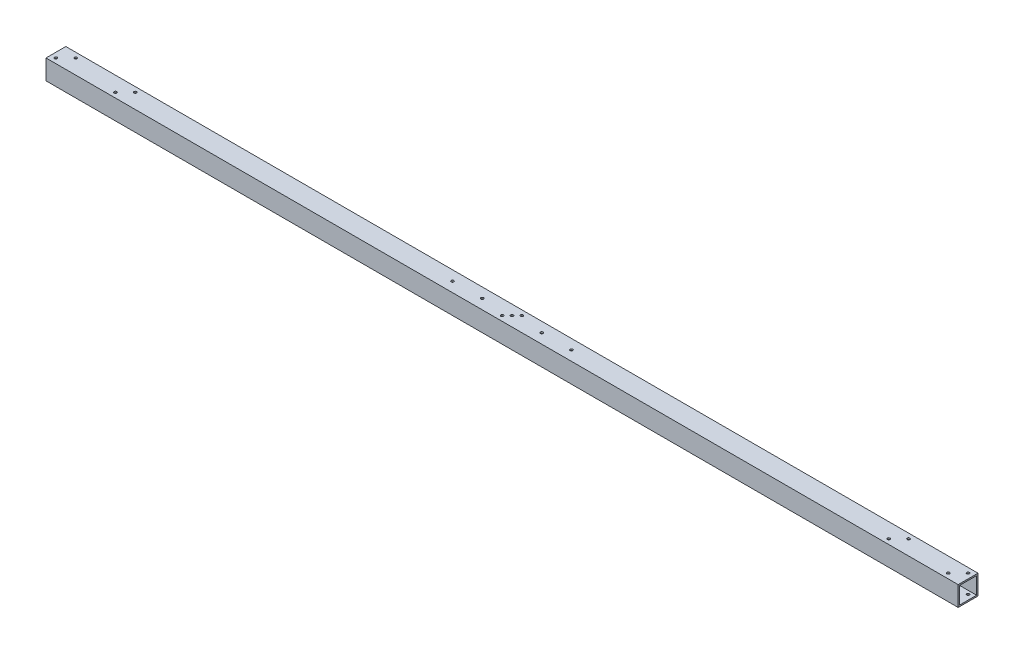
ISO-10303-21;
HEADER;
FILE_DESCRIPTION(('STEP AP214'),'2;1');
FILE_NAME('part.step','',(''),(''),'','','');
FILE_SCHEMA(('AUTOMOTIVE_DESIGN { 1 0 10303 214 1 1 1 1 }'));
ENDSEC;
DATA;
#1=APPLICATION_CONTEXT('core data for automotive mechanical design processes');
#2=APPLICATION_PROTOCOL_DEFINITION('international standard','automotive_design',2000,#1);
#3=PRODUCT_CONTEXT('',#1,'mechanical');
#4=PRODUCT('Part','Part','',(#3));
#5=PRODUCT_RELATED_PRODUCT_CATEGORY('part','',(#4));
#6=PRODUCT_DEFINITION_FORMATION('','',#4);
#7=PRODUCT_DEFINITION_CONTEXT('part definition',#1,'design');
#8=PRODUCT_DEFINITION('design','',#6,#7);
#9=PRODUCT_DEFINITION_SHAPE('','',#8);
#10=(LENGTH_UNIT() NAMED_UNIT(*) SI_UNIT(.MILLI.,.METRE.));
#11=(NAMED_UNIT(*) PLANE_ANGLE_UNIT() SI_UNIT($,.RADIAN.));
#12=(NAMED_UNIT(*) SI_UNIT($,.STERADIAN.) SOLID_ANGLE_UNIT());
#13=UNCERTAINTY_MEASURE_WITH_UNIT(LENGTH_MEASURE(1.E-05),#10,'distance_accuracy_value','');
#14=(GEOMETRIC_REPRESENTATION_CONTEXT(3) GLOBAL_UNCERTAINTY_ASSIGNED_CONTEXT((#13)) GLOBAL_UNIT_ASSIGNED_CONTEXT((#10,
#11,#12)) REPRESENTATION_CONTEXT('',''));
#15=CARTESIAN_POINT('',(0.,0.,0.));
#16=DIRECTION('',(0.,0.,1.));
#17=DIRECTION('',(1.,0.,0.));
#18=AXIS2_PLACEMENT_3D('',#15,#16,#17);
#19=CARTESIAN_POINT('',(2336.8,50.8,0.));
#20=DIRECTION('',(-1.,0.,0.));
#21=DIRECTION('',(0.,0.,1.));
#22=AXIS2_PLACEMENT_3D('',#19,#20,#21);
#23=PLANE('',#22);
#24=DIRECTION('',(0.,-1.,0.));
#25=VECTOR('',#24,1.);
#26=CARTESIAN_POINT('',(2336.8,0.,0.));
#27=LINE('',#26,#25);
#28=CARTESIAN_POINT('',(2336.8,50.8,0.));
#29=VERTEX_POINT('',#28);
#30=CARTESIAN_POINT('',(2336.8,0.,0.));
#31=VERTEX_POINT('',#30);
#32=EDGE_CURVE('E135',#29,#31,#27,.T.);
#33=ORIENTED_EDGE('',*,*,#32,.T.);
#34=DIRECTION('',(0.,0.,-1.));
#35=VECTOR('',#34,1.);
#36=CARTESIAN_POINT('',(2336.8,0.,0.));
#37=LINE('',#36,#35);
#38=CARTESIAN_POINT('',(2336.8,0.,-50.8));
#39=VERTEX_POINT('',#38);
#40=EDGE_CURVE('E138',#31,#39,#37,.T.);
#41=ORIENTED_EDGE('',*,*,#40,.T.);
#42=DIRECTION('',(0.,1.,0.));
#43=VECTOR('',#42,1.);
#44=CARTESIAN_POINT('',(2336.8,0.,-50.8));
#45=LINE('',#44,#43);
#46=CARTESIAN_POINT('',(2336.8,50.8,-50.8));
#47=VERTEX_POINT('',#46);
#48=EDGE_CURVE('E141',#39,#47,#45,.T.);
#49=ORIENTED_EDGE('',*,*,#48,.T.);
#50=DIRECTION('',(0.,0.,1.));
#51=VECTOR('',#50,1.);
#52=CARTESIAN_POINT('',(2336.8,50.8,0.));
#53=LINE('',#52,#51);
#54=EDGE_CURVE('E143',#47,#29,#53,.T.);
#55=ORIENTED_EDGE('',*,*,#54,.T.);
#56=EDGE_LOOP('',(#33,#41,#49,#55));
#57=FACE_BOUND('',#56,.T.);
#58=DIRECTION('',(0.,-1.,0.));
#59=VECTOR('',#58,1.);
#60=CARTESIAN_POINT('',(2336.8,47.1424,-3.6576));
#61=LINE('',#60,#59);
#62=CARTESIAN_POINT('',(2336.8,47.1424,-3.6576));
#63=VERTEX_POINT('',#62);
#64=CARTESIAN_POINT('',(2336.8,3.6576,-3.6576));
#65=VERTEX_POINT('',#64);
#66=EDGE_CURVE('E97',#63,#65,#61,.T.);
#67=ORIENTED_EDGE('',*,*,#66,.F.);
#68=DIRECTION('',(0.,0.,1.));
#69=VECTOR('',#68,1.);
#70=CARTESIAN_POINT('',(2336.8,47.1424,-3.6576));
#71=LINE('',#70,#69);
#72=CARTESIAN_POINT('',(2336.8,47.1424,-47.1424));
#73=VERTEX_POINT('',#72);
#74=EDGE_CURVE('E119',#73,#63,#71,.T.);
#75=ORIENTED_EDGE('',*,*,#74,.F.);
#76=DIRECTION('',(0.,1.,0.));
#77=VECTOR('',#76,1.);
#78=CARTESIAN_POINT('',(2336.8,47.1424,-47.1424));
#79=LINE('',#78,#77);
#80=CARTESIAN_POINT('',(2336.8,3.6576,-47.1424));
#81=VERTEX_POINT('',#80);
#82=EDGE_CURVE('E117',#81,#73,#79,.T.);
#83=ORIENTED_EDGE('',*,*,#82,.F.);
#84=DIRECTION('',(0.,0.,-1.));
#85=VECTOR('',#84,1.);
#86=CARTESIAN_POINT('',(2336.8,3.6576,-3.6576));
#87=LINE('',#86,#85);
#88=EDGE_CURVE('E105',#65,#81,#87,.T.);
#89=ORIENTED_EDGE('',*,*,#88,.F.);
#90=EDGE_LOOP('',(#67,#75,#83,#89));
#91=FACE_BOUND('',#90,.T.);
#92=ADVANCED_FACE('F30',(#57,#91),#23,.F.);
#93=CARTESIAN_POINT('',(0.,50.8,0.));
#94=DIRECTION('',(-1.,0.,0.));
#95=DIRECTION('',(0.,0.,1.));
#96=AXIS2_PLACEMENT_3D('',#93,#94,#95);
#97=PLANE('',#96);
#98=DIRECTION('',(0.,-1.,0.));
#99=VECTOR('',#98,1.);
#100=CARTESIAN_POINT('',(0.,0.,0.));
#101=LINE('',#100,#99);
#102=CARTESIAN_POINT('',(0.,50.8,0.));
#103=VERTEX_POINT('',#102);
#104=CARTESIAN_POINT('',(0.,0.,0.));
#105=VERTEX_POINT('',#104);
#106=EDGE_CURVE('E113',#103,#105,#101,.T.);
#107=ORIENTED_EDGE('',*,*,#106,.F.);
#108=DIRECTION('',(0.,0.,1.));
#109=VECTOR('',#108,1.);
#110=CARTESIAN_POINT('',(0.,50.8,0.));
#111=LINE('',#110,#109);
#112=CARTESIAN_POINT('',(0.,50.8,-50.8));
#113=VERTEX_POINT('',#112);
#114=EDGE_CURVE('E139',#113,#103,#111,.T.);
#115=ORIENTED_EDGE('',*,*,#114,.F.);
#116=DIRECTION('',(0.,1.,0.));
#117=VECTOR('',#116,1.);
#118=CARTESIAN_POINT('',(0.,0.,-50.8));
#119=LINE('',#118,#117);
#120=CARTESIAN_POINT('',(0.,0.,-50.8));
#121=VERTEX_POINT('',#120);
#122=EDGE_CURVE('E150',#121,#113,#119,.T.);
#123=ORIENTED_EDGE('',*,*,#122,.F.);
#124=DIRECTION('',(0.,0.,-1.));
#125=VECTOR('',#124,1.);
#126=CARTESIAN_POINT('',(0.,0.,0.));
#127=LINE('',#126,#125);
#128=EDGE_CURVE('E148',#105,#121,#127,.T.);
#129=ORIENTED_EDGE('',*,*,#128,.F.);
#130=EDGE_LOOP('',(#107,#115,#123,#129));
#131=FACE_BOUND('',#130,.T.);
#132=DIRECTION('',(0.,0.,1.));
#133=VECTOR('',#132,1.);
#134=CARTESIAN_POINT('',(0.,47.1424,-3.6576));
#135=LINE('',#134,#133);
#136=CARTESIAN_POINT('',(0.,47.1424,-47.1424));
#137=VERTEX_POINT('',#136);
#138=CARTESIAN_POINT('',(0.,47.1424,-3.6576));
#139=VERTEX_POINT('',#138);
#140=EDGE_CURVE('E106',#137,#139,#135,.T.);
#141=ORIENTED_EDGE('',*,*,#140,.T.);
#142=DIRECTION('',(0.,-1.,0.));
#143=VECTOR('',#142,1.);
#144=CARTESIAN_POINT('',(0.,47.1424,-3.6576));
#145=LINE('',#144,#143);
#146=CARTESIAN_POINT('',(0.,3.6576,-3.6576));
#147=VERTEX_POINT('',#146);
#148=EDGE_CURVE('E55',#139,#147,#145,.T.);
#149=ORIENTED_EDGE('',*,*,#148,.T.);
#150=DIRECTION('',(0.,0.,-1.));
#151=VECTOR('',#150,1.);
#152=CARTESIAN_POINT('',(0.,3.6576,-3.6576));
#153=LINE('',#152,#151);
#154=CARTESIAN_POINT('',(0.,3.6576,-47.1424));
#155=VERTEX_POINT('',#154);
#156=EDGE_CURVE('E112',#147,#155,#153,.T.);
#157=ORIENTED_EDGE('',*,*,#156,.T.);
#158=DIRECTION('',(0.,1.,0.));
#159=VECTOR('',#158,1.);
#160=CARTESIAN_POINT('',(0.,47.1424,-47.1424));
#161=LINE('',#160,#159);
#162=EDGE_CURVE('E127',#155,#137,#161,.T.);
#163=ORIENTED_EDGE('',*,*,#162,.T.);
#164=EDGE_LOOP('',(#141,#149,#157,#163));
#165=FACE_BOUND('',#164,.T.);
#166=ADVANCED_FACE('F352',(#131,#165),#97,.T.);
#167=CARTESIAN_POINT('',(2336.8,0.,0.));
#168=DIRECTION('',(0.,0.,-1.));
#169=DIRECTION('',(-1.,0.,0.));
#170=AXIS2_PLACEMENT_3D('',#167,#168,#169);
#171=PLANE('',#170);
#172=ORIENTED_EDGE('',*,*,#106,.T.);
#173=DIRECTION('',(-1.,0.,0.));
#174=VECTOR('',#173,1.);
#175=CARTESIAN_POINT('',(2336.8,0.,0.));
#176=LINE('',#175,#174);
#177=EDGE_CURVE('E11',#31,#105,#176,.T.);
#178=ORIENTED_EDGE('',*,*,#177,.F.);
#179=ORIENTED_EDGE('',*,*,#32,.F.);
#180=DIRECTION('',(-1.,0.,0.));
#181=VECTOR('',#180,1.);
#182=CARTESIAN_POINT('',(2336.8,50.8,0.));
#183=LINE('',#182,#181);
#184=EDGE_CURVE('E145',#29,#103,#183,.T.);
#185=ORIENTED_EDGE('',*,*,#184,.T.);
#186=EDGE_LOOP('',(#172,#178,#179,#185));
#187=FACE_BOUND('',#186,.T.);
#188=ADVANCED_FACE('F32',(#187),#171,.F.);
#189=CARTESIAN_POINT('',(2336.8,0.,0.));
#190=DIRECTION('',(0.,1.,0.));
#191=DIRECTION('',(0.,0.,1.));
#192=AXIS2_PLACEMENT_3D('',#189,#190,#191);
#193=PLANE('',#192);
#194=CARTESIAN_POINT('',(1181.09892463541,0.,-38.1000000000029));
#195=DIRECTION('',(0.,1.,0.));
#196=DIRECTION('',(0.,0.,1.));
#197=AXIS2_PLACEMENT_3D('',#194,#195,#196);
#198=CIRCLE('',#197,3.37312000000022);
#199=CARTESIAN_POINT('',(1181.09892463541,0.,-34.7268800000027));
#200=VERTEX_POINT('',#199);
#201=EDGE_CURVE('E376',#200,#200,#198,.T.);
#202=ORIENTED_EDGE('',*,*,#201,.T.);
#203=EDGE_LOOP('',(#202));
#204=FACE_BOUND('',#203,.T.);
#205=CARTESIAN_POINT('',(1155.69892463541,0.,-12.7000000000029));
#206=DIRECTION('',(0.,1.,0.));
#207=DIRECTION('',(0.,0.,1.));
#208=AXIS2_PLACEMENT_3D('',#205,#206,#207);
#209=CIRCLE('',#208,3.37312000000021);
#210=CARTESIAN_POINT('',(1155.69892463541,0.,-9.32688000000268));
#211=VERTEX_POINT('',#210);
#212=EDGE_CURVE('E226',#211,#211,#209,.T.);
#213=ORIENTED_EDGE('',*,*,#212,.T.);
#214=EDGE_LOOP('',(#213));
#215=FACE_BOUND('',#214,.T.);
#216=CARTESIAN_POINT('',(2171.7,0.,-38.1000000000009));
#217=DIRECTION('',(0.,1.,0.));
#218=DIRECTION('',(0.,0.,1.));
#219=AXIS2_PLACEMENT_3D('',#216,#217,#218);
#220=CIRCLE('',#219,3.3731200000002);
#221=CARTESIAN_POINT('',(2171.7,0.,-34.7268800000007));
#222=VERTEX_POINT('',#221);
#223=EDGE_CURVE('E222',#222,#222,#220,.T.);
#224=ORIENTED_EDGE('',*,*,#223,.T.);
#225=EDGE_LOOP('',(#224));
#226=FACE_BOUND('',#225,.T.);
#227=CARTESIAN_POINT('',(2146.3,0.,-12.7000000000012));
#228=DIRECTION('',(0.,1.,0.));
#229=DIRECTION('',(0.,0.,1.));
#230=AXIS2_PLACEMENT_3D('',#227,#228,#229);
#231=CIRCLE('',#230,3.3731200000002);
#232=CARTESIAN_POINT('',(2146.3,0.,-9.32688000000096));
#233=VERTEX_POINT('',#232);
#234=EDGE_CURVE('E218',#233,#233,#231,.T.);
#235=ORIENTED_EDGE('',*,*,#234,.T.);
#236=EDGE_LOOP('',(#235));
#237=FACE_BOUND('',#236,.T.);
#238=CARTESIAN_POINT('',(1320.79892463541,0.,-25.400000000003));
#239=DIRECTION('',(0.,-1.,0.));
#240=DIRECTION('',(0.,0.,-1.));
#241=AXIS2_PLACEMENT_3D('',#238,#239,#240);
#242=CIRCLE('',#241,3.37311999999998);
#243=CARTESIAN_POINT('',(1320.79892463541,0.,-28.773120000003));
#244=VERTEX_POINT('',#243);
#245=EDGE_CURVE('E256',#244,#244,#242,.T.);
#246=ORIENTED_EDGE('',*,*,#245,.F.);
#247=EDGE_LOOP('',(#246));
#248=FACE_BOUND('',#247,.T.);
#249=CARTESIAN_POINT('',(1244.59892463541,0.,-25.4000000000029));
#250=DIRECTION('',(0.,-1.,0.));
#251=DIRECTION('',(0.,0.,-1.));
#252=AXIS2_PLACEMENT_3D('',#249,#250,#251);
#253=CIRCLE('',#252,3.37311999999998);
#254=CARTESIAN_POINT('',(1244.59892463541,0.,-28.7731200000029));
#255=VERTEX_POINT('',#254);
#256=EDGE_CURVE('E263',#255,#255,#253,.T.);
#257=ORIENTED_EDGE('',*,*,#256,.F.);
#258=EDGE_LOOP('',(#257));
#259=FACE_BOUND('',#258,.T.);
#260=CARTESIAN_POINT('',(1015.99892463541,0.,-25.4000000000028));
#261=DIRECTION('',(0.,-1.,0.));
#262=DIRECTION('',(0.,0.,-1.));
#263=AXIS2_PLACEMENT_3D('',#260,#261,#262);
#264=CIRCLE('',#263,3.37311999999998);
#265=CARTESIAN_POINT('',(1015.99892463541,0.,-28.7731200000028));
#266=VERTEX_POINT('',#265);
#267=EDGE_CURVE('E270',#266,#266,#264,.T.);
#268=ORIENTED_EDGE('',*,*,#267,.F.);
#269=EDGE_LOOP('',(#268));
#270=FACE_BOUND('',#269,.T.);
#271=CARTESIAN_POINT('',(1092.19892463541,0.,-25.4000000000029));
#272=DIRECTION('',(0.,-1.,0.));
#273=DIRECTION('',(0.,0.,-1.));
#274=AXIS2_PLACEMENT_3D('',#271,#272,#273);
#275=CIRCLE('',#274,3.37311999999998);
#276=CARTESIAN_POINT('',(1092.19892463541,0.,-28.7731200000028));
#277=VERTEX_POINT('',#276);
#278=EDGE_CURVE('E277',#277,#277,#275,.T.);
#279=ORIENTED_EDGE('',*,*,#278,.F.);
#280=EDGE_LOOP('',(#279));
#281=FACE_BOUND('',#280,.T.);
#282=CARTESIAN_POINT('',(1168.39892463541,0.,-25.4000000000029));
#283=DIRECTION('',(0.,-1.,0.));
#284=DIRECTION('',(0.,0.,-1.));
#285=AXIS2_PLACEMENT_3D('',#282,#283,#284);
#286=CIRCLE('',#285,3.37311999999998);
#287=CARTESIAN_POINT('',(1168.39892463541,0.,-28.7731200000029));
#288=VERTEX_POINT('',#287);
#289=EDGE_CURVE('E284',#288,#288,#286,.T.);
#290=ORIENTED_EDGE('',*,*,#289,.F.);
#291=EDGE_LOOP('',(#290));
#292=FACE_BOUND('',#291,.T.);
#293=CARTESIAN_POINT('',(165.1,0.,-12.7));
#294=DIRECTION('',(0.,1.,0.));
#295=DIRECTION('',(0.,0.,1.));
#296=AXIS2_PLACEMENT_3D('',#293,#294,#295);
#297=CIRCLE('',#296,3.37312000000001);
#298=CARTESIAN_POINT('',(165.1,0.,-9.32687999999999));
#299=VERTEX_POINT('',#298);
#300=EDGE_CURVE('E188',#299,#299,#297,.T.);
#301=ORIENTED_EDGE('',*,*,#300,.T.);
#302=EDGE_LOOP('',(#301));
#303=FACE_BOUND('',#302,.T.);
#304=CARTESIAN_POINT('',(190.5,0.,-38.1));
#305=DIRECTION('',(0.,1.,0.));
#306=DIRECTION('',(0.,0.,1.));
#307=AXIS2_PLACEMENT_3D('',#304,#305,#306);
#308=CIRCLE('',#307,3.37312000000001);
#309=CARTESIAN_POINT('',(190.5,0.,-34.72688));
#310=VERTEX_POINT('',#309);
#311=EDGE_CURVE('E183',#310,#310,#308,.T.);
#312=ORIENTED_EDGE('',*,*,#311,.T.);
#313=EDGE_LOOP('',(#312));
#314=FACE_BOUND('',#313,.T.);
#315=CARTESIAN_POINT('',(2298.7,0.,-12.7));
#316=DIRECTION('',(0.,1.,0.));
#317=DIRECTION('',(0.,0.,1.));
#318=AXIS2_PLACEMENT_3D('',#315,#316,#317);
#319=CIRCLE('',#318,3.3731200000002);
#320=CARTESIAN_POINT('',(2298.7,0.,-9.32687999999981));
#321=VERTEX_POINT('',#320);
#322=EDGE_CURVE('E178',#321,#321,#319,.T.);
#323=ORIENTED_EDGE('',*,*,#322,.T.);
#324=EDGE_LOOP('',(#323));
#325=FACE_BOUND('',#324,.T.);
#326=CARTESIAN_POINT('',(2324.1,0.,-38.1));
#327=DIRECTION('',(0.,1.,0.));
#328=DIRECTION('',(0.,0.,1.));
#329=AXIS2_PLACEMENT_3D('',#326,#327,#328);
#330=CIRCLE('',#329,3.37312000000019);
#331=CARTESIAN_POINT('',(2324.1,0.,-34.7268799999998));
#332=VERTEX_POINT('',#331);
#333=EDGE_CURVE('E173',#332,#332,#330,.T.);
#334=ORIENTED_EDGE('',*,*,#333,.T.);
#335=EDGE_LOOP('',(#334));
#336=FACE_BOUND('',#335,.T.);
#337=CARTESIAN_POINT('',(38.1,0.,-38.1));
#338=DIRECTION('',(0.,1.,0.));
#339=DIRECTION('',(0.,0.,1.));
#340=AXIS2_PLACEMENT_3D('',#337,#338,#339);
#341=CIRCLE('',#340,3.37312);
#342=CARTESIAN_POINT('',(38.1,0.,-34.72688));
#343=VERTEX_POINT('',#342);
#344=EDGE_CURVE('E168',#343,#343,#341,.T.);
#345=ORIENTED_EDGE('',*,*,#344,.T.);
#346=EDGE_LOOP('',(#345));
#347=FACE_BOUND('',#346,.T.);
#348=CARTESIAN_POINT('',(12.7,0.,-12.7));
#349=DIRECTION('',(0.,1.,0.));
#350=DIRECTION('',(0.,0.,1.));
#351=AXIS2_PLACEMENT_3D('',#348,#349,#350);
#352=CIRCLE('',#351,3.37312);
#353=CARTESIAN_POINT('',(12.7,0.,-9.32688));
#354=VERTEX_POINT('',#353);
#355=EDGE_CURVE('E163',#354,#354,#352,.T.);
#356=ORIENTED_EDGE('',*,*,#355,.T.);
#357=EDGE_LOOP('',(#356));
#358=FACE_BOUND('',#357,.T.);
#359=ORIENTED_EDGE('',*,*,#128,.T.);
#360=DIRECTION('',(-1.,0.,0.));
#361=VECTOR('',#360,1.);
#362=CARTESIAN_POINT('',(2336.8,0.,-50.8));
#363=LINE('',#362,#361);
#364=EDGE_CURVE('E39',#39,#121,#363,.T.);
#365=ORIENTED_EDGE('',*,*,#364,.F.);
#366=ORIENTED_EDGE('',*,*,#40,.F.);
#367=ORIENTED_EDGE('',*,*,#177,.T.);
#368=EDGE_LOOP('',(#359,#365,#366,#367));
#369=FACE_BOUND('',#368,.T.);
#370=ADVANCED_FACE('F366',(#204,#215,#226,#237,#248,#259,#270,#281,#292,#303,#314,#325,#336,
#347,#358,#369),#193,.F.);
#371=CARTESIAN_POINT('',(2336.8,0.,-50.8));
#372=DIRECTION('',(0.,0.,1.));
#373=DIRECTION('',(1.,0.,0.));
#374=AXIS2_PLACEMENT_3D('',#371,#372,#373);
#375=PLANE('',#374);
#376=ORIENTED_EDGE('',*,*,#122,.T.);
#377=DIRECTION('',(-1.,0.,0.));
#378=VECTOR('',#377,1.);
#379=CARTESIAN_POINT('',(2336.8,50.8,-50.8));
#380=LINE('',#379,#378);
#381=EDGE_CURVE('E155',#47,#113,#380,.T.);
#382=ORIENTED_EDGE('',*,*,#381,.F.);
#383=ORIENTED_EDGE('',*,*,#48,.F.);
#384=ORIENTED_EDGE('',*,*,#364,.T.);
#385=EDGE_LOOP('',(#376,#382,#383,#384));
#386=FACE_BOUND('',#385,.T.);
#387=ADVANCED_FACE('F363',(#386),#375,.F.);
#388=CARTESIAN_POINT('',(2336.8,50.8,0.));
#389=DIRECTION('',(0.,-1.,0.));
#390=DIRECTION('',(0.,0.,-1.));
#391=AXIS2_PLACEMENT_3D('',#388,#389,#390);
#392=PLANE('',#391);
#393=CARTESIAN_POINT('',(1181.09892463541,50.8,-38.1000000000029));
#394=DIRECTION('',(0.,1.,0.));
#395=DIRECTION('',(0.,0.,1.));
#396=AXIS2_PLACEMENT_3D('',#393,#394,#395);
#397=CIRCLE('',#396,3.37312000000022);
#398=CARTESIAN_POINT('',(1181.09892463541,50.8,-34.7268800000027));
#399=VERTEX_POINT('',#398);
#400=EDGE_CURVE('E507',#399,#399,#397,.T.);
#401=ORIENTED_EDGE('',*,*,#400,.F.);
#402=EDGE_LOOP('',(#401));
#403=FACE_BOUND('',#402,.T.);
#404=CARTESIAN_POINT('',(1155.69892463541,50.8,-12.7000000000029));
#405=DIRECTION('',(0.,1.,0.));
#406=DIRECTION('',(0.,0.,1.));
#407=AXIS2_PLACEMENT_3D('',#404,#405,#406);
#408=CIRCLE('',#407,3.37312000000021);
#409=CARTESIAN_POINT('',(1155.69892463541,50.8,-9.32688000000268));
#410=VERTEX_POINT('',#409);
#411=EDGE_CURVE('E233',#410,#410,#408,.T.);
#412=ORIENTED_EDGE('',*,*,#411,.F.);
#413=EDGE_LOOP('',(#412));
#414=FACE_BOUND('',#413,.T.);
#415=CARTESIAN_POINT('',(2171.7,50.8,-38.1000000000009));
#416=DIRECTION('',(0.,1.,0.));
#417=DIRECTION('',(0.,0.,1.));
#418=AXIS2_PLACEMENT_3D('',#415,#416,#417);
#419=CIRCLE('',#418,3.3731200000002);
#420=CARTESIAN_POINT('',(2171.7,50.8,-34.7268800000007));
#421=VERTEX_POINT('',#420);
#422=EDGE_CURVE('E230',#421,#421,#419,.T.);
#423=ORIENTED_EDGE('',*,*,#422,.F.);
#424=EDGE_LOOP('',(#423));
#425=FACE_BOUND('',#424,.T.);
#426=CARTESIAN_POINT('',(2146.3,50.8,-12.7000000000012));
#427=DIRECTION('',(0.,1.,0.));
#428=DIRECTION('',(0.,0.,1.));
#429=AXIS2_PLACEMENT_3D('',#426,#427,#428);
#430=CIRCLE('',#429,3.3731200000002);
#431=CARTESIAN_POINT('',(2146.3,50.8,-9.32688000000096));
#432=VERTEX_POINT('',#431);
#433=EDGE_CURVE('E249',#432,#432,#430,.T.);
#434=ORIENTED_EDGE('',*,*,#433,.F.);
#435=EDGE_LOOP('',(#434));
#436=FACE_BOUND('',#435,.T.);
#437=CARTESIAN_POINT('',(1320.79892463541,50.8,-25.400000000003));
#438=DIRECTION('',(0.,-1.,0.));
#439=DIRECTION('',(0.,0.,-1.));
#440=AXIS2_PLACEMENT_3D('',#437,#438,#439);
#441=CIRCLE('',#440,3.37311999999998);
#442=CARTESIAN_POINT('',(1320.79892463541,50.8,-28.773120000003));
#443=VERTEX_POINT('',#442);
#444=EDGE_CURVE('E213',#443,#443,#441,.T.);
#445=ORIENTED_EDGE('',*,*,#444,.T.);
#446=EDGE_LOOP('',(#445));
#447=FACE_BOUND('',#446,.T.);
#448=CARTESIAN_POINT('',(1244.59892463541,50.8,-25.4000000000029));
#449=DIRECTION('',(0.,-1.,0.));
#450=DIRECTION('',(0.,0.,-1.));
#451=AXIS2_PLACEMENT_3D('',#448,#449,#450);
#452=CIRCLE('',#451,3.37311999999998);
#453=CARTESIAN_POINT('',(1244.59892463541,50.8,-28.7731200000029));
#454=VERTEX_POINT('',#453);
#455=EDGE_CURVE('E208',#454,#454,#452,.T.);
#456=ORIENTED_EDGE('',*,*,#455,.T.);
#457=EDGE_LOOP('',(#456));
#458=FACE_BOUND('',#457,.T.);
#459=CARTESIAN_POINT('',(1015.99892463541,50.8,-25.4000000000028));
#460=DIRECTION('',(0.,-1.,0.));
#461=DIRECTION('',(0.,0.,-1.));
#462=AXIS2_PLACEMENT_3D('',#459,#460,#461);
#463=CIRCLE('',#462,3.37311999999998);
#464=CARTESIAN_POINT('',(1015.99892463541,50.8,-28.7731200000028));
#465=VERTEX_POINT('',#464);
#466=EDGE_CURVE('E203',#465,#465,#463,.T.);
#467=ORIENTED_EDGE('',*,*,#466,.T.);
#468=EDGE_LOOP('',(#467));
#469=FACE_BOUND('',#468,.T.);
#470=CARTESIAN_POINT('',(1092.19892463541,50.8,-25.4000000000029));
#471=DIRECTION('',(0.,-1.,0.));
#472=DIRECTION('',(0.,0.,-1.));
#473=AXIS2_PLACEMENT_3D('',#470,#471,#472);
#474=CIRCLE('',#473,3.37311999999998);
#475=CARTESIAN_POINT('',(1092.19892463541,50.8,-28.7731200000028));
#476=VERTEX_POINT('',#475);
#477=EDGE_CURVE('E198',#476,#476,#474,.T.);
#478=ORIENTED_EDGE('',*,*,#477,.T.);
#479=EDGE_LOOP('',(#478));
#480=FACE_BOUND('',#479,.T.);
#481=CARTESIAN_POINT('',(1168.39892463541,50.8,-25.4000000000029));
#482=DIRECTION('',(0.,-1.,0.));
#483=DIRECTION('',(0.,0.,-1.));
#484=AXIS2_PLACEMENT_3D('',#481,#482,#483);
#485=CIRCLE('',#484,3.37311999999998);
#486=CARTESIAN_POINT('',(1168.39892463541,50.8,-28.7731200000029));
#487=VERTEX_POINT('',#486);
#488=EDGE_CURVE('E193',#487,#487,#485,.T.);
#489=ORIENTED_EDGE('',*,*,#488,.T.);
#490=EDGE_LOOP('',(#489));
#491=FACE_BOUND('',#490,.T.);
#492=CARTESIAN_POINT('',(165.1,50.8,-12.7));
#493=DIRECTION('',(0.,1.,0.));
#494=DIRECTION('',(0.,0.,1.));
#495=AXIS2_PLACEMENT_3D('',#492,#493,#494);
#496=CIRCLE('',#495,3.37312000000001);
#497=CARTESIAN_POINT('',(165.1,50.8,-9.32687999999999));
#498=VERTEX_POINT('',#497);
#499=EDGE_CURVE('E291',#498,#498,#496,.T.);
#500=ORIENTED_EDGE('',*,*,#499,.F.);
#501=EDGE_LOOP('',(#500));
#502=FACE_BOUND('',#501,.T.);
#503=CARTESIAN_POINT('',(190.5,50.8,-38.1));
#504=DIRECTION('',(0.,1.,0.));
#505=DIRECTION('',(0.,0.,1.));
#506=AXIS2_PLACEMENT_3D('',#503,#504,#505);
#507=CIRCLE('',#506,3.37312000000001);
#508=CARTESIAN_POINT('',(190.5,50.8,-34.72688));
#509=VERTEX_POINT('',#508);
#510=EDGE_CURVE('E298',#509,#509,#507,.T.);
#511=ORIENTED_EDGE('',*,*,#510,.F.);
#512=EDGE_LOOP('',(#511));
#513=FACE_BOUND('',#512,.T.);
#514=CARTESIAN_POINT('',(2298.7,50.8,-12.7));
#515=DIRECTION('',(0.,1.,0.));
#516=DIRECTION('',(0.,0.,1.));
#517=AXIS2_PLACEMENT_3D('',#514,#515,#516);
#518=CIRCLE('',#517,3.3731200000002);
#519=CARTESIAN_POINT('',(2298.7,50.8,-9.32687999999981));
#520=VERTEX_POINT('',#519);
#521=EDGE_CURVE('E305',#520,#520,#518,.T.);
#522=ORIENTED_EDGE('',*,*,#521,.F.);
#523=EDGE_LOOP('',(#522));
#524=FACE_BOUND('',#523,.T.);
#525=CARTESIAN_POINT('',(2324.1,50.8,-38.1));
#526=DIRECTION('',(0.,1.,0.));
#527=DIRECTION('',(0.,0.,1.));
#528=AXIS2_PLACEMENT_3D('',#525,#526,#527);
#529=CIRCLE('',#528,3.37312000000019);
#530=CARTESIAN_POINT('',(2324.1,50.8,-34.7268799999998));
#531=VERTEX_POINT('',#530);
#532=EDGE_CURVE('E312',#531,#531,#529,.T.);
#533=ORIENTED_EDGE('',*,*,#532,.F.);
#534=EDGE_LOOP('',(#533));
#535=FACE_BOUND('',#534,.T.);
#536=CARTESIAN_POINT('',(38.1,50.8,-38.1));
#537=DIRECTION('',(0.,1.,0.));
#538=DIRECTION('',(0.,0.,1.));
#539=AXIS2_PLACEMENT_3D('',#536,#537,#538);
#540=CIRCLE('',#539,3.37312);
#541=CARTESIAN_POINT('',(38.1,50.8,-34.72688));
#542=VERTEX_POINT('',#541);
#543=EDGE_CURVE('E319',#542,#542,#540,.T.);
#544=ORIENTED_EDGE('',*,*,#543,.F.);
#545=EDGE_LOOP('',(#544));
#546=FACE_BOUND('',#545,.T.);
#547=CARTESIAN_POINT('',(12.7,50.8,-12.7));
#548=DIRECTION('',(0.,1.,0.));
#549=DIRECTION('',(0.,0.,1.));
#550=AXIS2_PLACEMENT_3D('',#547,#548,#549);
#551=CIRCLE('',#550,3.37312);
#552=CARTESIAN_POINT('',(12.7,50.8,-9.32688));
#553=VERTEX_POINT('',#552);
#554=EDGE_CURVE('E326',#553,#553,#551,.T.);
#555=ORIENTED_EDGE('',*,*,#554,.F.);
#556=EDGE_LOOP('',(#555));
#557=FACE_BOUND('',#556,.T.);
#558=ORIENTED_EDGE('',*,*,#114,.T.);
#559=ORIENTED_EDGE('',*,*,#184,.F.);
#560=ORIENTED_EDGE('',*,*,#54,.F.);
#561=ORIENTED_EDGE('',*,*,#381,.T.);
#562=EDGE_LOOP('',(#558,#559,#560,#561));
#563=FACE_BOUND('',#562,.T.);
#564=ADVANCED_FACE('F347',(#403,#414,#425,#436,#447,#458,#469,#480,#491,#502,#513,#524,#535,
#546,#557,#563),#392,.F.);
#565=CARTESIAN_POINT('',(2336.8,47.1424,-3.6576));
#566=DIRECTION('',(0.,0.,-1.));
#567=DIRECTION('',(0.,1.,0.));
#568=AXIS2_PLACEMENT_3D('',#565,#566,#567);
#569=PLANE('',#568);
#570=ORIENTED_EDGE('',*,*,#148,.F.);
#571=DIRECTION('',(-1.,0.,0.));
#572=VECTOR('',#571,1.);
#573=CARTESIAN_POINT('',(2336.8,47.1424,-3.6576));
#574=LINE('',#573,#572);
#575=EDGE_CURVE('E101',#63,#139,#574,.T.);
#576=ORIENTED_EDGE('',*,*,#575,.F.);
#577=ORIENTED_EDGE('',*,*,#66,.T.);
#578=DIRECTION('',(-1.,0.,0.));
#579=VECTOR('',#578,1.);
#580=CARTESIAN_POINT('',(2336.8,3.6576,-3.6576));
#581=LINE('',#580,#579);
#582=EDGE_CURVE('E100',#65,#147,#581,.T.);
#583=ORIENTED_EDGE('',*,*,#582,.T.);
#584=EDGE_LOOP('',(#570,#576,#577,#583));
#585=FACE_BOUND('',#584,.T.);
#586=ADVANCED_FACE('F99',(#585),#569,.T.);
#587=CARTESIAN_POINT('',(2336.8,3.6576,-3.6576));
#588=DIRECTION('',(0.,1.,0.));
#589=DIRECTION('',(0.,0.,1.));
#590=AXIS2_PLACEMENT_3D('',#587,#588,#589);
#591=PLANE('',#590);
#592=CARTESIAN_POINT('',(1181.09892463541,3.6576,-38.1000000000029));
#593=DIRECTION('',(0.,1.,0.));
#594=DIRECTION('',(0.,0.,1.));
#595=AXIS2_PLACEMENT_3D('',#592,#593,#594);
#596=CIRCLE('',#595,3.37312000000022);
#597=CARTESIAN_POINT('',(1181.09892463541,3.6576,-34.7268800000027));
#598=VERTEX_POINT('',#597);
#599=EDGE_CURVE('E238',#598,#598,#596,.T.);
#600=ORIENTED_EDGE('',*,*,#599,.F.);
#601=EDGE_LOOP('',(#600));
#602=FACE_BOUND('',#601,.T.);
#603=CARTESIAN_POINT('',(1155.69892463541,3.6576,-12.7000000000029));
#604=DIRECTION('',(0.,1.,0.));
#605=DIRECTION('',(0.,0.,1.));
#606=AXIS2_PLACEMENT_3D('',#603,#604,#605);
#607=CIRCLE('',#606,3.37312000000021);
#608=CARTESIAN_POINT('',(1155.69892463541,3.6576,-9.32688000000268));
#609=VERTEX_POINT('',#608);
#610=EDGE_CURVE('E225',#609,#609,#607,.T.);
#611=ORIENTED_EDGE('',*,*,#610,.F.);
#612=EDGE_LOOP('',(#611));
#613=FACE_BOUND('',#612,.T.);
#614=CARTESIAN_POINT('',(2171.7,3.6576,-38.1000000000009));
#615=DIRECTION('',(0.,1.,0.));
#616=DIRECTION('',(0.,0.,1.));
#617=AXIS2_PLACEMENT_3D('',#614,#615,#616);
#618=CIRCLE('',#617,3.3731200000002);
#619=CARTESIAN_POINT('',(2171.7,3.6576,-34.7268800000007));
#620=VERTEX_POINT('',#619);
#621=EDGE_CURVE('E221',#620,#620,#618,.T.);
#622=ORIENTED_EDGE('',*,*,#621,.F.);
#623=EDGE_LOOP('',(#622));
#624=FACE_BOUND('',#623,.T.);
#625=CARTESIAN_POINT('',(2146.3,3.6576,-12.7000000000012));
#626=DIRECTION('',(0.,1.,0.));
#627=DIRECTION('',(0.,0.,1.));
#628=AXIS2_PLACEMENT_3D('',#625,#626,#627);
#629=CIRCLE('',#628,3.3731200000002);
#630=CARTESIAN_POINT('',(2146.3,3.6576,-9.32688000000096));
#631=VERTEX_POINT('',#630);
#632=EDGE_CURVE('E217',#631,#631,#629,.T.);
#633=ORIENTED_EDGE('',*,*,#632,.F.);
#634=EDGE_LOOP('',(#633));
#635=FACE_BOUND('',#634,.T.);
#636=CARTESIAN_POINT('',(1320.79892463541,3.6576,-25.400000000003));
#637=DIRECTION('',(0.,1.,0.));
#638=DIRECTION('',(0.,0.,1.));
#639=AXIS2_PLACEMENT_3D('',#636,#637,#638);
#640=CIRCLE('',#639,3.37311999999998);
#641=CARTESIAN_POINT('',(1320.79892463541,3.6576,-22.026880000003));
#642=VERTEX_POINT('',#641);
#643=EDGE_CURVE('E212',#642,#642,#640,.T.);
#644=ORIENTED_EDGE('',*,*,#643,.F.);
#645=EDGE_LOOP('',(#644));
#646=FACE_BOUND('',#645,.T.);
#647=CARTESIAN_POINT('',(1244.59892463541,3.6576,-25.4000000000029));
#648=DIRECTION('',(0.,1.,0.));
#649=DIRECTION('',(0.,0.,1.));
#650=AXIS2_PLACEMENT_3D('',#647,#648,#649);
#651=CIRCLE('',#650,3.37311999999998);
#652=CARTESIAN_POINT('',(1244.59892463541,3.6576,-22.026880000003));
#653=VERTEX_POINT('',#652);
#654=EDGE_CURVE('E207',#653,#653,#651,.T.);
#655=ORIENTED_EDGE('',*,*,#654,.F.);
#656=EDGE_LOOP('',(#655));
#657=FACE_BOUND('',#656,.T.);
#658=CARTESIAN_POINT('',(1015.99892463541,3.6576,-25.4000000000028));
#659=DIRECTION('',(0.,1.,0.));
#660=DIRECTION('',(0.,0.,1.));
#661=AXIS2_PLACEMENT_3D('',#658,#659,#660);
#662=CIRCLE('',#661,3.37311999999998);
#663=CARTESIAN_POINT('',(1015.99892463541,3.6576,-22.0268800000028));
#664=VERTEX_POINT('',#663);
#665=EDGE_CURVE('E202',#664,#664,#662,.T.);
#666=ORIENTED_EDGE('',*,*,#665,.F.);
#667=EDGE_LOOP('',(#666));
#668=FACE_BOUND('',#667,.T.);
#669=CARTESIAN_POINT('',(1092.19892463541,3.6576,-25.4000000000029));
#670=DIRECTION('',(0.,1.,0.));
#671=DIRECTION('',(0.,0.,1.));
#672=AXIS2_PLACEMENT_3D('',#669,#670,#671);
#673=CIRCLE('',#672,3.37311999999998);
#674=CARTESIAN_POINT('',(1092.19892463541,3.6576,-22.0268800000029));
#675=VERTEX_POINT('',#674);
#676=EDGE_CURVE('E197',#675,#675,#673,.T.);
#677=ORIENTED_EDGE('',*,*,#676,.F.);
#678=EDGE_LOOP('',(#677));
#679=FACE_BOUND('',#678,.T.);
#680=CARTESIAN_POINT('',(1168.39892463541,3.6576,-25.4000000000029));
#681=DIRECTION('',(0.,1.,0.));
#682=DIRECTION('',(0.,0.,1.));
#683=AXIS2_PLACEMENT_3D('',#680,#681,#682);
#684=CIRCLE('',#683,3.37311999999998);
#685=CARTESIAN_POINT('',(1168.39892463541,3.6576,-22.0268800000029));
#686=VERTEX_POINT('',#685);
#687=EDGE_CURVE('E192',#686,#686,#684,.T.);
#688=ORIENTED_EDGE('',*,*,#687,.F.);
#689=EDGE_LOOP('',(#688));
#690=FACE_BOUND('',#689,.T.);
#691=CARTESIAN_POINT('',(165.1,3.6576,-12.7));
#692=DIRECTION('',(0.,1.,0.));
#693=DIRECTION('',(0.,0.,1.));
#694=AXIS2_PLACEMENT_3D('',#691,#692,#693);
#695=CIRCLE('',#694,3.37312000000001);
#696=CARTESIAN_POINT('',(165.1,3.6576,-9.32687999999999));
#697=VERTEX_POINT('',#696);
#698=EDGE_CURVE('E187',#697,#697,#695,.T.);
#699=ORIENTED_EDGE('',*,*,#698,.F.);
#700=EDGE_LOOP('',(#699));
#701=FACE_BOUND('',#700,.T.);
#702=CARTESIAN_POINT('',(190.5,3.6576,-38.1));
#703=DIRECTION('',(0.,1.,0.));
#704=DIRECTION('',(0.,0.,1.));
#705=AXIS2_PLACEMENT_3D('',#702,#703,#704);
#706=CIRCLE('',#705,3.37312000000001);
#707=CARTESIAN_POINT('',(190.5,3.6576,-34.72688));
#708=VERTEX_POINT('',#707);
#709=EDGE_CURVE('E182',#708,#708,#706,.T.);
#710=ORIENTED_EDGE('',*,*,#709,.F.);
#711=EDGE_LOOP('',(#710));
#712=FACE_BOUND('',#711,.T.);
#713=CARTESIAN_POINT('',(2298.7,3.6576,-12.7));
#714=DIRECTION('',(0.,1.,0.));
#715=DIRECTION('',(0.,0.,1.));
#716=AXIS2_PLACEMENT_3D('',#713,#714,#715);
#717=CIRCLE('',#716,3.3731200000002);
#718=CARTESIAN_POINT('',(2298.7,3.6576,-9.32687999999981));
#719=VERTEX_POINT('',#718);
#720=EDGE_CURVE('E177',#719,#719,#717,.T.);
#721=ORIENTED_EDGE('',*,*,#720,.F.);
#722=EDGE_LOOP('',(#721));
#723=FACE_BOUND('',#722,.T.);
#724=CARTESIAN_POINT('',(2324.1,3.6576,-38.1));
#725=DIRECTION('',(0.,1.,0.));
#726=DIRECTION('',(0.,0.,1.));
#727=AXIS2_PLACEMENT_3D('',#724,#725,#726);
#728=CIRCLE('',#727,3.37312000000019);
#729=CARTESIAN_POINT('',(2324.1,3.6576,-34.7268799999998));
#730=VERTEX_POINT('',#729);
#731=EDGE_CURVE('E172',#730,#730,#728,.T.);
#732=ORIENTED_EDGE('',*,*,#731,.F.);
#733=EDGE_LOOP('',(#732));
#734=FACE_BOUND('',#733,.T.);
#735=CARTESIAN_POINT('',(38.1,3.6576,-38.1));
#736=DIRECTION('',(0.,1.,0.));
#737=DIRECTION('',(0.,0.,1.));
#738=AXIS2_PLACEMENT_3D('',#735,#736,#737);
#739=CIRCLE('',#738,3.37312);
#740=CARTESIAN_POINT('',(38.1,3.6576,-34.72688));
#741=VERTEX_POINT('',#740);
#742=EDGE_CURVE('E167',#741,#741,#739,.T.);
#743=ORIENTED_EDGE('',*,*,#742,.F.);
#744=EDGE_LOOP('',(#743));
#745=FACE_BOUND('',#744,.T.);
#746=CARTESIAN_POINT('',(12.7,3.6576,-12.7));
#747=DIRECTION('',(0.,1.,0.));
#748=DIRECTION('',(0.,0.,1.));
#749=AXIS2_PLACEMENT_3D('',#746,#747,#748);
#750=CIRCLE('',#749,3.37312);
#751=CARTESIAN_POINT('',(12.7,3.6576,-9.32688));
#752=VERTEX_POINT('',#751);
#753=EDGE_CURVE('E125',#752,#752,#750,.T.);
#754=ORIENTED_EDGE('',*,*,#753,.F.);
#755=EDGE_LOOP('',(#754));
#756=FACE_BOUND('',#755,.T.);
#757=ORIENTED_EDGE('',*,*,#156,.F.);
#758=ORIENTED_EDGE('',*,*,#582,.F.);
#759=ORIENTED_EDGE('',*,*,#88,.T.);
#760=DIRECTION('',(-1.,0.,0.));
#761=VECTOR('',#760,1.);
#762=CARTESIAN_POINT('',(2336.8,3.6576,-47.1424));
#763=LINE('',#762,#761);
#764=EDGE_CURVE('E114',#81,#155,#763,.T.);
#765=ORIENTED_EDGE('',*,*,#764,.T.);
#766=EDGE_LOOP('',(#757,#758,#759,#765));
#767=FACE_BOUND('',#766,.T.);
#768=ADVANCED_FACE('F109',(#602,#613,#624,#635,#646,#657,#668,#679,#690,#701,#712,#723,#734,
#745,#756,#767),#591,.T.);
#769=CARTESIAN_POINT('',(2336.8,47.1424,-47.1424));
#770=DIRECTION('',(0.,0.,1.));
#771=DIRECTION('',(0.,-1.,0.));
#772=AXIS2_PLACEMENT_3D('',#769,#770,#771);
#773=PLANE('',#772);
#774=ORIENTED_EDGE('',*,*,#162,.F.);
#775=ORIENTED_EDGE('',*,*,#764,.F.);
#776=ORIENTED_EDGE('',*,*,#82,.T.);
#777=DIRECTION('',(-1.,0.,0.));
#778=VECTOR('',#777,1.);
#779=CARTESIAN_POINT('',(2336.8,47.1424,-47.1424));
#780=LINE('',#779,#778);
#781=EDGE_CURVE('E47',#73,#137,#780,.T.);
#782=ORIENTED_EDGE('',*,*,#781,.T.);
#783=EDGE_LOOP('',(#774,#775,#776,#782));
#784=FACE_BOUND('',#783,.T.);
#785=ADVANCED_FACE('F337',(#784),#773,.T.);
#786=CARTESIAN_POINT('',(2336.8,47.1424,-3.6576));
#787=DIRECTION('',(0.,-1.,0.));
#788=DIRECTION('',(0.,0.,-1.));
#789=AXIS2_PLACEMENT_3D('',#786,#787,#788);
#790=PLANE('',#789);
#791=CARTESIAN_POINT('',(1181.09892463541,47.1424,-38.1000000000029));
#792=DIRECTION('',(0.,-1.,0.));
#793=DIRECTION('',(0.,0.,-1.));
#794=AXIS2_PLACEMENT_3D('',#791,#792,#793);
#795=CIRCLE('',#794,3.37312000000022);
#796=CARTESIAN_POINT('',(1181.09892463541,47.1424,-41.4731200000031));
#797=VERTEX_POINT('',#796);
#798=EDGE_CURVE('E34',#797,#797,#795,.T.);
#799=ORIENTED_EDGE('',*,*,#798,.F.);
#800=EDGE_LOOP('',(#799));
#801=FACE_BOUND('',#800,.T.);
#802=CARTESIAN_POINT('',(1155.69892463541,47.1424,-12.7000000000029));
#803=DIRECTION('',(0.,-1.,0.));
#804=DIRECTION('',(0.,0.,-1.));
#805=AXIS2_PLACEMENT_3D('',#802,#803,#804);
#806=CIRCLE('',#805,3.37312000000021);
#807=CARTESIAN_POINT('',(1155.69892463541,47.1424,-16.0731200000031));
#808=VERTEX_POINT('',#807);
#809=EDGE_CURVE('E223',#808,#808,#806,.T.);
#810=ORIENTED_EDGE('',*,*,#809,.F.);
#811=EDGE_LOOP('',(#810));
#812=FACE_BOUND('',#811,.T.);
#813=CARTESIAN_POINT('',(2171.7,47.1424,-38.1000000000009));
#814=DIRECTION('',(0.,-1.,0.));
#815=DIRECTION('',(0.,0.,-1.));
#816=AXIS2_PLACEMENT_3D('',#813,#814,#815);
#817=CIRCLE('',#816,3.3731200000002);
#818=CARTESIAN_POINT('',(2171.7,47.1424,-41.4731200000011));
#819=VERTEX_POINT('',#818);
#820=EDGE_CURVE('E219',#819,#819,#817,.T.);
#821=ORIENTED_EDGE('',*,*,#820,.F.);
#822=EDGE_LOOP('',(#821));
#823=FACE_BOUND('',#822,.T.);
#824=CARTESIAN_POINT('',(2146.3,47.1424,-12.7000000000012));
#825=DIRECTION('',(0.,-1.,0.));
#826=DIRECTION('',(0.,0.,-1.));
#827=AXIS2_PLACEMENT_3D('',#824,#825,#826);
#828=CIRCLE('',#827,3.3731200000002);
#829=CARTESIAN_POINT('',(2146.3,47.1424,-16.0731200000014));
#830=VERTEX_POINT('',#829);
#831=EDGE_CURVE('E214',#830,#830,#828,.T.);
#832=ORIENTED_EDGE('',*,*,#831,.F.);
#833=EDGE_LOOP('',(#832));
#834=FACE_BOUND('',#833,.T.);
#835=CARTESIAN_POINT('',(1320.79892463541,47.1424,-25.400000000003));
#836=DIRECTION('',(0.,-1.,0.));
#837=DIRECTION('',(0.,0.,-1.));
#838=AXIS2_PLACEMENT_3D('',#835,#836,#837);
#839=CIRCLE('',#838,3.37311999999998);
#840=CARTESIAN_POINT('',(1320.79892463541,47.1424,-28.773120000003));
#841=VERTEX_POINT('',#840);
#842=EDGE_CURVE('E209',#841,#841,#839,.T.);
#843=ORIENTED_EDGE('',*,*,#842,.F.);
#844=EDGE_LOOP('',(#843));
#845=FACE_BOUND('',#844,.T.);
#846=CARTESIAN_POINT('',(1244.59892463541,47.1424,-25.4000000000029));
#847=DIRECTION('',(0.,-1.,0.));
#848=DIRECTION('',(0.,0.,-1.));
#849=AXIS2_PLACEMENT_3D('',#846,#847,#848);
#850=CIRCLE('',#849,3.37311999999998);
#851=CARTESIAN_POINT('',(1244.59892463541,47.1424,-28.7731200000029));
#852=VERTEX_POINT('',#851);
#853=EDGE_CURVE('E204',#852,#852,#850,.T.);
#854=ORIENTED_EDGE('',*,*,#853,.F.);
#855=EDGE_LOOP('',(#854));
#856=FACE_BOUND('',#855,.T.);
#857=CARTESIAN_POINT('',(1015.99892463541,47.1424,-25.4000000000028));
#858=DIRECTION('',(0.,-1.,0.));
#859=DIRECTION('',(0.,0.,-1.));
#860=AXIS2_PLACEMENT_3D('',#857,#858,#859);
#861=CIRCLE('',#860,3.37311999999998);
#862=CARTESIAN_POINT('',(1015.99892463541,47.1424,-28.7731200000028));
#863=VERTEX_POINT('',#862);
#864=EDGE_CURVE('E199',#863,#863,#861,.T.);
#865=ORIENTED_EDGE('',*,*,#864,.F.);
#866=EDGE_LOOP('',(#865));
#867=FACE_BOUND('',#866,.T.);
#868=CARTESIAN_POINT('',(1092.19892463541,47.1424,-25.4000000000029));
#869=DIRECTION('',(0.,-1.,0.));
#870=DIRECTION('',(0.,0.,-1.));
#871=AXIS2_PLACEMENT_3D('',#868,#869,#870);
#872=CIRCLE('',#871,3.37311999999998);
#873=CARTESIAN_POINT('',(1092.19892463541,47.1424,-28.7731200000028));
#874=VERTEX_POINT('',#873);
#875=EDGE_CURVE('E194',#874,#874,#872,.T.);
#876=ORIENTED_EDGE('',*,*,#875,.F.);
#877=EDGE_LOOP('',(#876));
#878=FACE_BOUND('',#877,.T.);
#879=CARTESIAN_POINT('',(1168.39892463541,47.1424,-25.4000000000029));
#880=DIRECTION('',(0.,-1.,0.));
#881=DIRECTION('',(0.,0.,-1.));
#882=AXIS2_PLACEMENT_3D('',#879,#880,#881);
#883=CIRCLE('',#882,3.37311999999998);
#884=CARTESIAN_POINT('',(1168.39892463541,47.1424,-28.7731200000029));
#885=VERTEX_POINT('',#884);
#886=EDGE_CURVE('E189',#885,#885,#883,.T.);
#887=ORIENTED_EDGE('',*,*,#886,.F.);
#888=EDGE_LOOP('',(#887));
#889=FACE_BOUND('',#888,.T.);
#890=CARTESIAN_POINT('',(165.1,47.1424,-12.7));
#891=DIRECTION('',(0.,-1.,0.));
#892=DIRECTION('',(0.,0.,-1.));
#893=AXIS2_PLACEMENT_3D('',#890,#891,#892);
#894=CIRCLE('',#893,3.37312000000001);
#895=CARTESIAN_POINT('',(165.1,47.1424,-16.07312));
#896=VERTEX_POINT('',#895);
#897=EDGE_CURVE('E184',#896,#896,#894,.T.);
#898=ORIENTED_EDGE('',*,*,#897,.F.);
#899=EDGE_LOOP('',(#898));
#900=FACE_BOUND('',#899,.T.);
#901=CARTESIAN_POINT('',(190.5,47.1424,-38.1));
#902=DIRECTION('',(0.,-1.,0.));
#903=DIRECTION('',(0.,0.,-1.));
#904=AXIS2_PLACEMENT_3D('',#901,#902,#903);
#905=CIRCLE('',#904,3.37312000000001);
#906=CARTESIAN_POINT('',(190.5,47.1424,-41.47312));
#907=VERTEX_POINT('',#906);
#908=EDGE_CURVE('E179',#907,#907,#905,.T.);
#909=ORIENTED_EDGE('',*,*,#908,.F.);
#910=EDGE_LOOP('',(#909));
#911=FACE_BOUND('',#910,.T.);
#912=CARTESIAN_POINT('',(2298.7,47.1424,-12.7));
#913=DIRECTION('',(0.,-1.,0.));
#914=DIRECTION('',(0.,0.,-1.));
#915=AXIS2_PLACEMENT_3D('',#912,#913,#914);
#916=CIRCLE('',#915,3.3731200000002);
#917=CARTESIAN_POINT('',(2298.7,47.1424,-16.0731200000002));
#918=VERTEX_POINT('',#917);
#919=EDGE_CURVE('E174',#918,#918,#916,.T.);
#920=ORIENTED_EDGE('',*,*,#919,.F.);
#921=EDGE_LOOP('',(#920));
#922=FACE_BOUND('',#921,.T.);
#923=CARTESIAN_POINT('',(2324.1,47.1424,-38.1));
#924=DIRECTION('',(0.,-1.,0.));
#925=DIRECTION('',(0.,0.,-1.));
#926=AXIS2_PLACEMENT_3D('',#923,#924,#925);
#927=CIRCLE('',#926,3.37312000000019);
#928=CARTESIAN_POINT('',(2324.1,47.1424,-41.4731200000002));
#929=VERTEX_POINT('',#928);
#930=EDGE_CURVE('E169',#929,#929,#927,.T.);
#931=ORIENTED_EDGE('',*,*,#930,.F.);
#932=EDGE_LOOP('',(#931));
#933=FACE_BOUND('',#932,.T.);
#934=CARTESIAN_POINT('',(38.1,47.1424,-38.1));
#935=DIRECTION('',(0.,-1.,0.));
#936=DIRECTION('',(0.,0.,-1.));
#937=AXIS2_PLACEMENT_3D('',#934,#935,#936);
#938=CIRCLE('',#937,3.37312);
#939=CARTESIAN_POINT('',(38.1,47.1424,-41.47312));
#940=VERTEX_POINT('',#939);
#941=EDGE_CURVE('E164',#940,#940,#938,.T.);
#942=ORIENTED_EDGE('',*,*,#941,.F.);
#943=EDGE_LOOP('',(#942));
#944=FACE_BOUND('',#943,.T.);
#945=CARTESIAN_POINT('',(12.7,47.1424,-12.7));
#946=DIRECTION('',(0.,-1.,0.));
#947=DIRECTION('',(0.,0.,-1.));
#948=AXIS2_PLACEMENT_3D('',#945,#946,#947);
#949=CIRCLE('',#948,3.37312);
#950=CARTESIAN_POINT('',(12.7,47.1424,-16.07312));
#951=VERTEX_POINT('',#950);
#952=EDGE_CURVE('E160',#951,#951,#949,.T.);
#953=ORIENTED_EDGE('',*,*,#952,.F.);
#954=EDGE_LOOP('',(#953));
#955=FACE_BOUND('',#954,.T.);
#956=ORIENTED_EDGE('',*,*,#140,.F.);
#957=ORIENTED_EDGE('',*,*,#781,.F.);
#958=ORIENTED_EDGE('',*,*,#74,.T.);
#959=ORIENTED_EDGE('',*,*,#575,.T.);
#960=EDGE_LOOP('',(#956,#957,#958,#959));
#961=FACE_BOUND('',#960,.T.);
#962=ADVANCED_FACE('F344',(#801,#812,#823,#834,#845,#856,#867,#878,#889,#900,#911,#922,#933,
#944,#955,#961),#790,.T.);
#963=CARTESIAN_POINT('',(12.7,0.,-12.7));
#964=DIRECTION('',(0.,1.,0.));
#965=DIRECTION('',(0.,0.,1.));
#966=AXIS2_PLACEMENT_3D('',#963,#964,#965);
#967=CYLINDRICAL_SURFACE('',#966,3.37312);
#968=ORIENTED_EDGE('',*,*,#952,.T.);
#969=EDGE_LOOP('',(#968));
#970=FACE_BOUND('',#969,.T.);
#971=ORIENTED_EDGE('',*,*,#554,.T.);
#972=EDGE_LOOP('',(#971));
#973=FACE_BOUND('',#972,.T.);
#974=ADVANCED_FACE('F418',(#970,#973),#967,.F.);
#975=ORIENTED_EDGE('',*,*,#753,.T.);
#976=EDGE_LOOP('',(#975));
#977=FACE_BOUND('',#976,.T.);
#978=ORIENTED_EDGE('',*,*,#355,.F.);
#979=EDGE_LOOP('',(#978));
#980=FACE_BOUND('',#979,.T.);
#981=ADVANCED_FACE('F333',(#977,#980),#967,.F.);
#982=CARTESIAN_POINT('',(38.1,0.,-38.1));
#983=DIRECTION('',(0.,1.,0.));
#984=DIRECTION('',(0.,0.,1.));
#985=AXIS2_PLACEMENT_3D('',#982,#983,#984);
#986=CYLINDRICAL_SURFACE('',#985,3.37312);
#987=ORIENTED_EDGE('',*,*,#941,.T.);
#988=EDGE_LOOP('',(#987));
#989=FACE_BOUND('',#988,.T.);
#990=ORIENTED_EDGE('',*,*,#543,.T.);
#991=EDGE_LOOP('',(#990));
#992=FACE_BOUND('',#991,.T.);
#993=ADVANCED_FACE('F429',(#989,#992),#986,.F.);
#994=ORIENTED_EDGE('',*,*,#742,.T.);
#995=EDGE_LOOP('',(#994));
#996=FACE_BOUND('',#995,.T.);
#997=ORIENTED_EDGE('',*,*,#344,.F.);
#998=EDGE_LOOP('',(#997));
#999=FACE_BOUND('',#998,.T.);
#1000=ADVANCED_FACE('F432',(#996,#999),#986,.F.);
#1001=CARTESIAN_POINT('',(2324.1,0.,-38.1));
#1002=DIRECTION('',(0.,1.,0.));
#1003=DIRECTION('',(0.,0.,1.));
#1004=AXIS2_PLACEMENT_3D('',#1001,#1002,#1003);
#1005=CYLINDRICAL_SURFACE('',#1004,3.37312000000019);
#1006=ORIENTED_EDGE('',*,*,#930,.T.);
#1007=EDGE_LOOP('',(#1006));
#1008=FACE_BOUND('',#1007,.T.);
#1009=ORIENTED_EDGE('',*,*,#532,.T.);
#1010=EDGE_LOOP('',(#1009));
#1011=FACE_BOUND('',#1010,.T.);
#1012=ADVANCED_FACE('F434',(#1008,#1011),#1005,.F.);
#1013=ORIENTED_EDGE('',*,*,#731,.T.);
#1014=EDGE_LOOP('',(#1013));
#1015=FACE_BOUND('',#1014,.T.);
#1016=ORIENTED_EDGE('',*,*,#333,.F.);
#1017=EDGE_LOOP('',(#1016));
#1018=FACE_BOUND('',#1017,.T.);
#1019=ADVANCED_FACE('F437',(#1015,#1018),#1005,.F.);
#1020=CARTESIAN_POINT('',(2298.7,0.,-12.7));
#1021=DIRECTION('',(0.,1.,0.));
#1022=DIRECTION('',(0.,0.,1.));
#1023=AXIS2_PLACEMENT_3D('',#1020,#1021,#1022);
#1024=CYLINDRICAL_SURFACE('',#1023,3.3731200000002);
#1025=ORIENTED_EDGE('',*,*,#919,.T.);
#1026=EDGE_LOOP('',(#1025));
#1027=FACE_BOUND('',#1026,.T.);
#1028=ORIENTED_EDGE('',*,*,#521,.T.);
#1029=EDGE_LOOP('',(#1028));
#1030=FACE_BOUND('',#1029,.T.);
#1031=ADVANCED_FACE('F439',(#1027,#1030),#1024,.F.);
#1032=ORIENTED_EDGE('',*,*,#720,.T.);
#1033=EDGE_LOOP('',(#1032));
#1034=FACE_BOUND('',#1033,.T.);
#1035=ORIENTED_EDGE('',*,*,#322,.F.);
#1036=EDGE_LOOP('',(#1035));
#1037=FACE_BOUND('',#1036,.T.);
#1038=ADVANCED_FACE('F442',(#1034,#1037),#1024,.F.);
#1039=CARTESIAN_POINT('',(190.5,0.,-38.1));
#1040=DIRECTION('',(0.,1.,0.));
#1041=DIRECTION('',(0.,0.,1.));
#1042=AXIS2_PLACEMENT_3D('',#1039,#1040,#1041);
#1043=CYLINDRICAL_SURFACE('',#1042,3.37312000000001);
#1044=ORIENTED_EDGE('',*,*,#908,.T.);
#1045=EDGE_LOOP('',(#1044));
#1046=FACE_BOUND('',#1045,.T.);
#1047=ORIENTED_EDGE('',*,*,#510,.T.);
#1048=EDGE_LOOP('',(#1047));
#1049=FACE_BOUND('',#1048,.T.);
#1050=ADVANCED_FACE('F444',(#1046,#1049),#1043,.F.);
#1051=ORIENTED_EDGE('',*,*,#709,.T.);
#1052=EDGE_LOOP('',(#1051));
#1053=FACE_BOUND('',#1052,.T.);
#1054=ORIENTED_EDGE('',*,*,#311,.F.);
#1055=EDGE_LOOP('',(#1054));
#1056=FACE_BOUND('',#1055,.T.);
#1057=ADVANCED_FACE('F447',(#1053,#1056),#1043,.F.);
#1058=CARTESIAN_POINT('',(165.1,0.,-12.7));
#1059=DIRECTION('',(0.,1.,0.));
#1060=DIRECTION('',(0.,0.,1.));
#1061=AXIS2_PLACEMENT_3D('',#1058,#1059,#1060);
#1062=CYLINDRICAL_SURFACE('',#1061,3.37312000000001);
#1063=ORIENTED_EDGE('',*,*,#897,.T.);
#1064=EDGE_LOOP('',(#1063));
#1065=FACE_BOUND('',#1064,.T.);
#1066=ORIENTED_EDGE('',*,*,#499,.T.);
#1067=EDGE_LOOP('',(#1066));
#1068=FACE_BOUND('',#1067,.T.);
#1069=ADVANCED_FACE('F449',(#1065,#1068),#1062,.F.);
#1070=ORIENTED_EDGE('',*,*,#698,.T.);
#1071=EDGE_LOOP('',(#1070));
#1072=FACE_BOUND('',#1071,.T.);
#1073=ORIENTED_EDGE('',*,*,#300,.F.);
#1074=EDGE_LOOP('',(#1073));
#1075=FACE_BOUND('',#1074,.T.);
#1076=ADVANCED_FACE('F452',(#1072,#1075),#1062,.F.);
#1077=CARTESIAN_POINT('',(1168.39892463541,50.8,-25.4000000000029));
#1078=DIRECTION('',(0.,-1.,0.));
#1079=DIRECTION('',(0.,0.,-1.));
#1080=AXIS2_PLACEMENT_3D('',#1077,#1078,#1079);
#1081=CYLINDRICAL_SURFACE('',#1080,3.37311999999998);
#1082=ORIENTED_EDGE('',*,*,#886,.T.);
#1083=EDGE_LOOP('',(#1082));
#1084=FACE_BOUND('',#1083,.T.);
#1085=ORIENTED_EDGE('',*,*,#488,.F.);
#1086=EDGE_LOOP('',(#1085));
#1087=FACE_BOUND('',#1086,.T.);
#1088=ADVANCED_FACE('F454',(#1084,#1087),#1081,.F.);
#1089=ORIENTED_EDGE('',*,*,#687,.T.);
#1090=EDGE_LOOP('',(#1089));
#1091=FACE_BOUND('',#1090,.T.);
#1092=ORIENTED_EDGE('',*,*,#289,.T.);
#1093=EDGE_LOOP('',(#1092));
#1094=FACE_BOUND('',#1093,.T.);
#1095=ADVANCED_FACE('F457',(#1091,#1094),#1081,.F.);
#1096=CARTESIAN_POINT('',(1092.19892463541,50.8,-25.4000000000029));
#1097=DIRECTION('',(0.,-1.,0.));
#1098=DIRECTION('',(0.,0.,-1.));
#1099=AXIS2_PLACEMENT_3D('',#1096,#1097,#1098);
#1100=CYLINDRICAL_SURFACE('',#1099,3.37311999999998);
#1101=ORIENTED_EDGE('',*,*,#875,.T.);
#1102=EDGE_LOOP('',(#1101));
#1103=FACE_BOUND('',#1102,.T.);
#1104=ORIENTED_EDGE('',*,*,#477,.F.);
#1105=EDGE_LOOP('',(#1104));
#1106=FACE_BOUND('',#1105,.T.);
#1107=ADVANCED_FACE('F459',(#1103,#1106),#1100,.F.);
#1108=ORIENTED_EDGE('',*,*,#676,.T.);
#1109=EDGE_LOOP('',(#1108));
#1110=FACE_BOUND('',#1109,.T.);
#1111=ORIENTED_EDGE('',*,*,#278,.T.);
#1112=EDGE_LOOP('',(#1111));
#1113=FACE_BOUND('',#1112,.T.);
#1114=ADVANCED_FACE('F462',(#1110,#1113),#1100,.F.);
#1115=CARTESIAN_POINT('',(1015.99892463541,50.8,-25.4000000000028));
#1116=DIRECTION('',(0.,-1.,0.));
#1117=DIRECTION('',(0.,0.,-1.));
#1118=AXIS2_PLACEMENT_3D('',#1115,#1116,#1117);
#1119=CYLINDRICAL_SURFACE('',#1118,3.37311999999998);
#1120=ORIENTED_EDGE('',*,*,#864,.T.);
#1121=EDGE_LOOP('',(#1120));
#1122=FACE_BOUND('',#1121,.T.);
#1123=ORIENTED_EDGE('',*,*,#466,.F.);
#1124=EDGE_LOOP('',(#1123));
#1125=FACE_BOUND('',#1124,.T.);
#1126=ADVANCED_FACE('F464',(#1122,#1125),#1119,.F.);
#1127=ORIENTED_EDGE('',*,*,#665,.T.);
#1128=EDGE_LOOP('',(#1127));
#1129=FACE_BOUND('',#1128,.T.);
#1130=ORIENTED_EDGE('',*,*,#267,.T.);
#1131=EDGE_LOOP('',(#1130));
#1132=FACE_BOUND('',#1131,.T.);
#1133=ADVANCED_FACE('F467',(#1129,#1132),#1119,.F.);
#1134=CARTESIAN_POINT('',(1244.59892463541,50.8,-25.4000000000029));
#1135=DIRECTION('',(0.,-1.,0.));
#1136=DIRECTION('',(0.,0.,-1.));
#1137=AXIS2_PLACEMENT_3D('',#1134,#1135,#1136);
#1138=CYLINDRICAL_SURFACE('',#1137,3.37311999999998);
#1139=ORIENTED_EDGE('',*,*,#853,.T.);
#1140=EDGE_LOOP('',(#1139));
#1141=FACE_BOUND('',#1140,.T.);
#1142=ORIENTED_EDGE('',*,*,#455,.F.);
#1143=EDGE_LOOP('',(#1142));
#1144=FACE_BOUND('',#1143,.T.);
#1145=ADVANCED_FACE('F469',(#1141,#1144),#1138,.F.);
#1146=ORIENTED_EDGE('',*,*,#654,.T.);
#1147=EDGE_LOOP('',(#1146));
#1148=FACE_BOUND('',#1147,.T.);
#1149=ORIENTED_EDGE('',*,*,#256,.T.);
#1150=EDGE_LOOP('',(#1149));
#1151=FACE_BOUND('',#1150,.T.);
#1152=ADVANCED_FACE('F472',(#1148,#1151),#1138,.F.);
#1153=CARTESIAN_POINT('',(1320.79892463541,50.8,-25.400000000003));
#1154=DIRECTION('',(0.,-1.,0.));
#1155=DIRECTION('',(0.,0.,-1.));
#1156=AXIS2_PLACEMENT_3D('',#1153,#1154,#1155);
#1157=CYLINDRICAL_SURFACE('',#1156,3.37311999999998);
#1158=ORIENTED_EDGE('',*,*,#842,.T.);
#1159=EDGE_LOOP('',(#1158));
#1160=FACE_BOUND('',#1159,.T.);
#1161=ORIENTED_EDGE('',*,*,#444,.F.);
#1162=EDGE_LOOP('',(#1161));
#1163=FACE_BOUND('',#1162,.T.);
#1164=ADVANCED_FACE('F474',(#1160,#1163),#1157,.F.);
#1165=ORIENTED_EDGE('',*,*,#643,.T.);
#1166=EDGE_LOOP('',(#1165));
#1167=FACE_BOUND('',#1166,.T.);
#1168=ORIENTED_EDGE('',*,*,#245,.T.);
#1169=EDGE_LOOP('',(#1168));
#1170=FACE_BOUND('',#1169,.T.);
#1171=ADVANCED_FACE('F477',(#1167,#1170),#1157,.F.);
#1172=CARTESIAN_POINT('',(2146.3,0.,-12.7000000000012));
#1173=DIRECTION('',(0.,1.,0.));
#1174=DIRECTION('',(0.,0.,1.));
#1175=AXIS2_PLACEMENT_3D('',#1172,#1173,#1174);
#1176=CYLINDRICAL_SURFACE('',#1175,3.3731200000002);
#1177=ORIENTED_EDGE('',*,*,#831,.T.);
#1178=EDGE_LOOP('',(#1177));
#1179=FACE_BOUND('',#1178,.T.);
#1180=ORIENTED_EDGE('',*,*,#433,.T.);
#1181=EDGE_LOOP('',(#1180));
#1182=FACE_BOUND('',#1181,.T.);
#1183=ADVANCED_FACE('F479',(#1179,#1182),#1176,.F.);
#1184=ORIENTED_EDGE('',*,*,#632,.T.);
#1185=EDGE_LOOP('',(#1184));
#1186=FACE_BOUND('',#1185,.T.);
#1187=ORIENTED_EDGE('',*,*,#234,.F.);
#1188=EDGE_LOOP('',(#1187));
#1189=FACE_BOUND('',#1188,.T.);
#1190=ADVANCED_FACE('F482',(#1186,#1189),#1176,.F.);
#1191=CARTESIAN_POINT('',(2171.7,0.,-38.1000000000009));
#1192=DIRECTION('',(0.,1.,0.));
#1193=DIRECTION('',(0.,0.,1.));
#1194=AXIS2_PLACEMENT_3D('',#1191,#1192,#1193);
#1195=CYLINDRICAL_SURFACE('',#1194,3.3731200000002);
#1196=ORIENTED_EDGE('',*,*,#820,.T.);
#1197=EDGE_LOOP('',(#1196));
#1198=FACE_BOUND('',#1197,.T.);
#1199=ORIENTED_EDGE('',*,*,#422,.T.);
#1200=EDGE_LOOP('',(#1199));
#1201=FACE_BOUND('',#1200,.T.);
#1202=ADVANCED_FACE('F484',(#1198,#1201),#1195,.F.);
#1203=ORIENTED_EDGE('',*,*,#621,.T.);
#1204=EDGE_LOOP('',(#1203));
#1205=FACE_BOUND('',#1204,.T.);
#1206=ORIENTED_EDGE('',*,*,#223,.F.);
#1207=EDGE_LOOP('',(#1206));
#1208=FACE_BOUND('',#1207,.T.);
#1209=ADVANCED_FACE('F487',(#1205,#1208),#1195,.F.);
#1210=CARTESIAN_POINT('',(1155.69892463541,0.,-12.7000000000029));
#1211=DIRECTION('',(0.,1.,0.));
#1212=DIRECTION('',(0.,0.,1.));
#1213=AXIS2_PLACEMENT_3D('',#1210,#1211,#1212);
#1214=CYLINDRICAL_SURFACE('',#1213,3.37312000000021);
#1215=ORIENTED_EDGE('',*,*,#809,.T.);
#1216=EDGE_LOOP('',(#1215));
#1217=FACE_BOUND('',#1216,.T.);
#1218=ORIENTED_EDGE('',*,*,#411,.T.);
#1219=EDGE_LOOP('',(#1218));
#1220=FACE_BOUND('',#1219,.T.);
#1221=ADVANCED_FACE('F489',(#1217,#1220),#1214,.F.);
#1222=ORIENTED_EDGE('',*,*,#610,.T.);
#1223=EDGE_LOOP('',(#1222));
#1224=FACE_BOUND('',#1223,.T.);
#1225=ORIENTED_EDGE('',*,*,#212,.F.);
#1226=EDGE_LOOP('',(#1225));
#1227=FACE_BOUND('',#1226,.T.);
#1228=ADVANCED_FACE('F492',(#1224,#1227),#1214,.F.);
#1229=CARTESIAN_POINT('',(1181.09892463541,0.,-38.1000000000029));
#1230=DIRECTION('',(0.,1.,0.));
#1231=DIRECTION('',(0.,0.,1.));
#1232=AXIS2_PLACEMENT_3D('',#1229,#1230,#1231);
#1233=CYLINDRICAL_SURFACE('',#1232,3.37312000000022);
#1234=ORIENTED_EDGE('',*,*,#798,.T.);
#1235=EDGE_LOOP('',(#1234));
#1236=FACE_BOUND('',#1235,.T.);
#1237=ORIENTED_EDGE('',*,*,#400,.T.);
#1238=EDGE_LOOP('',(#1237));
#1239=FACE_BOUND('',#1238,.T.);
#1240=ADVANCED_FACE('F493',(#1236,#1239),#1233,.F.);
#1241=ORIENTED_EDGE('',*,*,#599,.T.);
#1242=EDGE_LOOP('',(#1241));
#1243=FACE_BOUND('',#1242,.T.);
#1244=ORIENTED_EDGE('',*,*,#201,.F.);
#1245=EDGE_LOOP('',(#1244));
#1246=FACE_BOUND('',#1245,.T.);
#1247=ADVANCED_FACE('F495',(#1243,#1246),#1233,.F.);
#1248=CLOSED_SHELL('',(#92,#166,#188,#370,#387,#564,#586,#768,#785,#962,#974,#981,#993,#1000,
#1012,#1019,#1031,#1038,#1050,#1057,#1069,#1076,#1088,#1095,#1107,#1114,#1126,#1133,#1145,#1152,
#1164,#1171,#1183,#1190,#1202,#1209,#1221,#1228,#1240,#1247));
#1249=MANIFOLD_SOLID_BREP('B2',#1248);
#1250=ADVANCED_BREP_SHAPE_REPRESENTATION('',(#18,#1249),#14);
#1251=SHAPE_DEFINITION_REPRESENTATION(#9,#1250);
ENDSEC;
END-ISO-10303-21;
